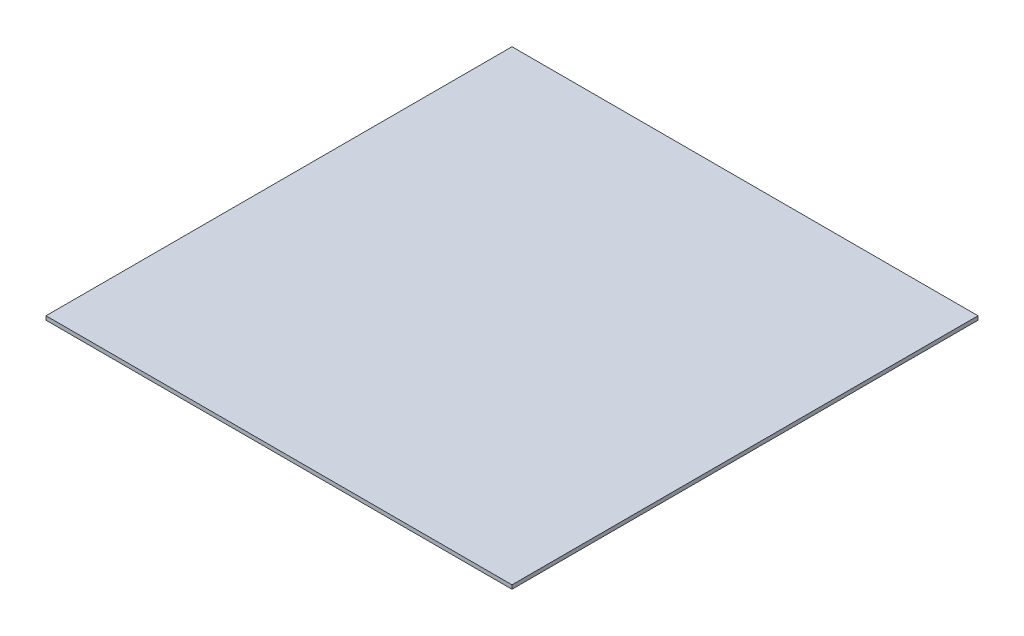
from build123d import *

# Parameters (mm, degrees)
SKETCH1_W           = 304.8
SKETCH1_H           = 304.8
BOSS_EXTRUDE1_DEPTH = 2.54


with BuildPart() as part:
    # Sketch1 → Boss-Extrude1 (new body)
    with BuildSketch(Plane(origin=(0, 0, 0), x_dir=(1, 0, 0), z_dir=(0, 1, 0))):
        Rectangle(SKETCH1_W, SKETCH1_H)
    extrude(amount=BOSS_EXTRUDE1_DEPTH)


solid = part.part
